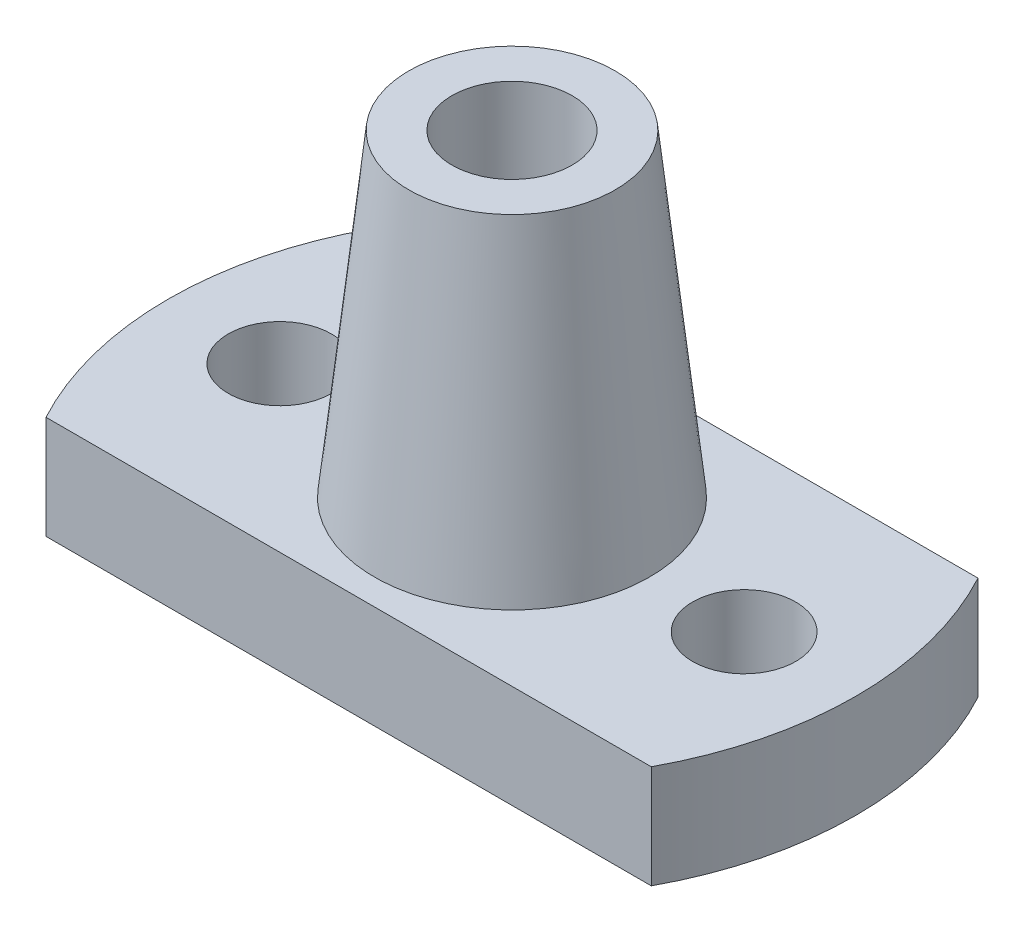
from build123d import *

# Parameters (mm, degrees)
SKETCH_2_R          = 6
SKETCH_2_W          = 96.852227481
SKETCH_2_H          = 26.120576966
CUT_EXTRUDE_1_DEPTH = 68.594378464


with BuildPart() as part:
    # Sketch 1 → Revolve 1 (revolve)
    with BuildSketch(Plane.XY, mode=Mode.PRIVATE) as revolve_1_sk:
        Polygon((7, 0), (40, 0), (40, 12), (16, 12), (12, 49), (7, 49), align=None)
    revolve(revolve_1_sk.sketch.rotate(Axis((0, 0, 0), (0, 1, 0)), 90), axis=Axis((0, 0, 0), (0, 1, 0)))

    # Sketch 2 → Cut-Extrude 1 (cut, through all)
    with BuildSketch(Plane(origin=(0, 12, 0), x_dir=(1, 0, 0), z_dir=(0, 1, 0))):
        with Locations(Location((27, 0, 0), (0, 0, 270))):
            Circle(SKETCH_2_R)
        with Locations(Location((-27, 0, 0), (0, 0, 90))):
            Circle(SKETCH_2_R)
        with Locations((-1.818045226, 32.060288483)):
            Rectangle(SKETCH_2_W, SKETCH_2_H)
        with Locations((-1.818045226, -32.060288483)):
            Rectangle(SKETCH_2_W, SKETCH_2_H)
    extrude(amount=-CUT_EXTRUDE_1_DEPTH, mode=Mode.SUBTRACT)


solid = part.part
